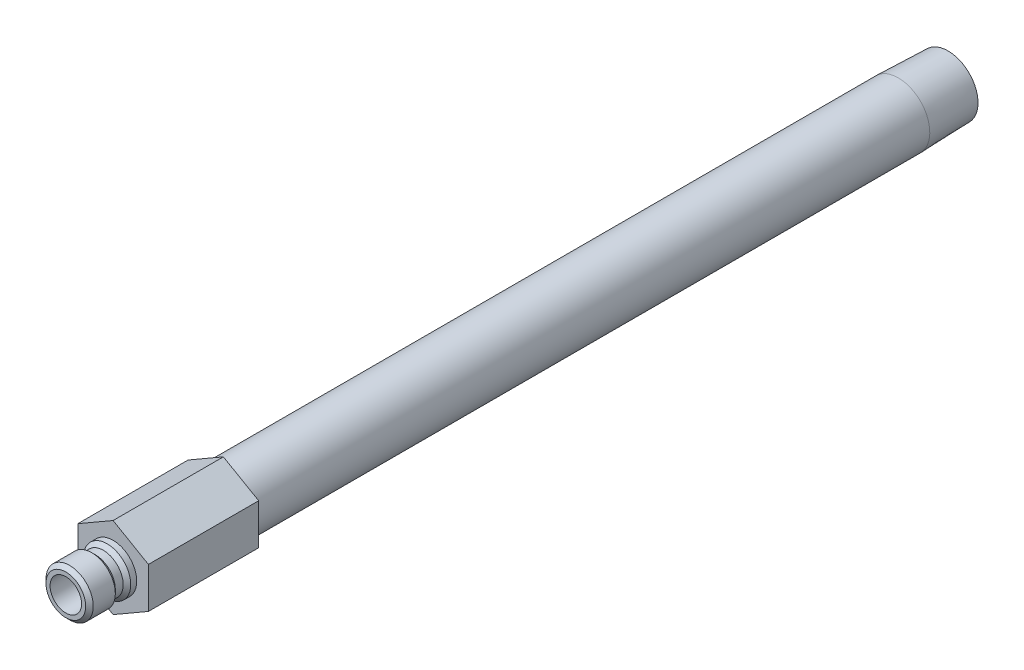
ISO-10303-21;
HEADER;
FILE_DESCRIPTION(('STEP AP214'),'2;1');
FILE_NAME('part.step','',(''),(''),'','','');
FILE_SCHEMA(('AUTOMOTIVE_DESIGN { 1 0 10303 214 1 1 1 1 }'));
ENDSEC;
DATA;
#1=APPLICATION_CONTEXT('core data for automotive mechanical design processes');
#2=APPLICATION_PROTOCOL_DEFINITION('international standard','automotive_design',2000,#1);
#3=PRODUCT_CONTEXT('',#1,'mechanical');
#4=PRODUCT('Part','Part','',(#3));
#5=PRODUCT_RELATED_PRODUCT_CATEGORY('part','',(#4));
#6=PRODUCT_DEFINITION_FORMATION('','',#4);
#7=PRODUCT_DEFINITION_CONTEXT('part definition',#1,'design');
#8=PRODUCT_DEFINITION('design','',#6,#7);
#9=PRODUCT_DEFINITION_SHAPE('','',#8);
#10=(LENGTH_UNIT() NAMED_UNIT(*) SI_UNIT(.MILLI.,.METRE.));
#11=(NAMED_UNIT(*) PLANE_ANGLE_UNIT() SI_UNIT($,.RADIAN.));
#12=(NAMED_UNIT(*) SI_UNIT($,.STERADIAN.) SOLID_ANGLE_UNIT());
#13=UNCERTAINTY_MEASURE_WITH_UNIT(LENGTH_MEASURE(1.E-05),#10,'distance_accuracy_value','');
#14=(GEOMETRIC_REPRESENTATION_CONTEXT(3) GLOBAL_UNCERTAINTY_ASSIGNED_CONTEXT((#13)) GLOBAL_UNIT_ASSIGNED_CONTEXT((#10,
#11,#12)) REPRESENTATION_CONTEXT('',''));
#15=CARTESIAN_POINT('',(0.,0.,0.));
#16=DIRECTION('',(0.,0.,1.));
#17=DIRECTION('',(1.,0.,0.));
#18=AXIS2_PLACEMENT_3D('',#15,#16,#17);
#19=CARTESIAN_POINT('',(0.,0.,0.));
#20=DIRECTION('',(0.,0.,-1.));
#21=DIRECTION('',(0.,1.,0.));
#22=AXIS2_PLACEMENT_3D('',#19,#20,#21);
#23=CYLINDRICAL_SURFACE('',#22,6.34999999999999);
#24=CARTESIAN_POINT('',(0.,0.,-158.242));
#25=DIRECTION('',(0.,0.,-1.));
#26=DIRECTION('',(0.,1.,0.));
#27=AXIS2_PLACEMENT_3D('',#24,#25,#26);
#28=CIRCLE('',#27,6.34999999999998);
#29=CARTESIAN_POINT('',(0.,6.35,-158.242));
#30=VERTEX_POINT('',#29);
#31=EDGE_CURVE('E42',#30,#30,#28,.T.);
#32=ORIENTED_EDGE('',*,*,#31,.F.);
#33=EDGE_LOOP('',(#32));
#34=FACE_BOUND('',#33,.T.);
#35=CARTESIAN_POINT('',(0.,0.,-22.225));
#36=DIRECTION('',(0.,0.,1.));
#37=DIRECTION('',(1.,0.,0.));
#38=AXIS2_PLACEMENT_3D('',#35,#36,#37);
#39=CIRCLE('',#38,6.34999999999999);
#40=CARTESIAN_POINT('',(6.34999999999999,0.,-22.225));
#41=VERTEX_POINT('',#40);
#42=EDGE_CURVE('E138',#41,#41,#39,.F.);
#43=ORIENTED_EDGE('',*,*,#42,.T.);
#44=EDGE_LOOP('',(#43));
#45=FACE_BOUND('',#44,.T.);
#46=ADVANCED_FACE('F33',(#34,#45),#23,.T.);
#47=CARTESIAN_POINT('',(0.,6.03647060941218,-168.275));
#48=DIRECTION('',(0.,0.,-1.));
#49=DIRECTION('',(0.,1.,0.));
#50=AXIS2_PLACEMENT_3D('',#47,#48,#49);
#51=PLANE('',#50);
#52=CARTESIAN_POINT('',(0.,0.,-168.275));
#53=DIRECTION('',(0.,0.,-1.));
#54=DIRECTION('',(0.,1.,0.));
#55=AXIS2_PLACEMENT_3D('',#52,#53,#54);
#56=CIRCLE('',#55,6.03647060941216);
#57=CARTESIAN_POINT('',(0.,6.03647060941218,-168.275));
#58=VERTEX_POINT('',#57);
#59=EDGE_CURVE('E11',#58,#58,#56,.T.);
#60=ORIENTED_EDGE('',*,*,#59,.T.);
#61=EDGE_LOOP('',(#60));
#62=FACE_BOUND('',#61,.T.);
#63=CARTESIAN_POINT('',(0.,0.,-168.275));
#64=DIRECTION('',(0.,0.,-1.));
#65=DIRECTION('',(0.,1.,0.));
#66=AXIS2_PLACEMENT_3D('',#63,#64,#65);
#67=CIRCLE('',#66,4.62279999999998);
#68=CARTESIAN_POINT('',(0.,4.6228,-168.275));
#69=VERTEX_POINT('',#68);
#70=EDGE_CURVE('E146',#69,#69,#67,.T.);
#71=ORIENTED_EDGE('',*,*,#70,.F.);
#72=EDGE_LOOP('',(#71));
#73=FACE_BOUND('',#72,.T.);
#74=ADVANCED_FACE('F35',(#62,#73),#51,.T.);
#75=CARTESIAN_POINT('',(0.,0.,-168.275));
#76=DIRECTION('',(0.,0.,1.));
#77=DIRECTION('',(0.,-1.,0.));
#78=AXIS2_PLACEMENT_3D('',#75,#76,#77);
#79=CONICAL_SURFACE('',#78,6.03647060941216,0.0312396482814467);
#80=ORIENTED_EDGE('',*,*,#31,.T.);
#81=EDGE_LOOP('',(#80));
#82=FACE_BOUND('',#81,.T.);
#83=ORIENTED_EDGE('',*,*,#59,.F.);
#84=EDGE_LOOP('',(#83));
#85=FACE_BOUND('',#84,.T.);
#86=ADVANCED_FACE('F181',(#82,#85),#79,.T.);
#87=CARTESIAN_POINT('',(0.,4.7625,0.));
#88=DIRECTION('',(0.,0.,1.));
#89=DIRECTION('',(0.,-1.,0.));
#90=AXIS2_PLACEMENT_3D('',#87,#88,#89);
#91=PLANE('',#90);
#92=CARTESIAN_POINT('',(0.,0.,0.));
#93=DIRECTION('',(0.,0.,-1.));
#94=DIRECTION('',(0.,1.,0.));
#95=AXIS2_PLACEMENT_3D('',#92,#93,#94);
#96=CIRCLE('',#95,4.7625);
#97=CARTESIAN_POINT('',(0.,4.7625,0.));
#98=VERTEX_POINT('',#97);
#99=EDGE_CURVE('E176',#98,#98,#96,.T.);
#100=ORIENTED_EDGE('',*,*,#99,.T.);
#101=EDGE_LOOP('',(#100));
#102=FACE_BOUND('',#101,.T.);
#103=DIRECTION('',(-0.866025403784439,-0.5,0.));
#104=VECTOR('',#103,1.);
#105=CARTESIAN_POINT('',(0.,8.21223022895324,0.));
#106=LINE('',#105,#104);
#107=CARTESIAN_POINT('',(0.,8.21223022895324,0.));
#108=VERTEX_POINT('',#107);
#109=CARTESIAN_POINT('',(-7.112,4.10611511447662,0.));
#110=VERTEX_POINT('',#109);
#111=EDGE_CURVE('E121',#108,#110,#106,.T.);
#112=ORIENTED_EDGE('',*,*,#111,.T.);
#113=DIRECTION('',(0.,-1.,0.));
#114=VECTOR('',#113,1.);
#115=CARTESIAN_POINT('',(-7.112,4.10611511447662,0.));
#116=LINE('',#115,#114);
#117=CARTESIAN_POINT('',(-7.112,-4.10611511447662,0.));
#118=VERTEX_POINT('',#117);
#119=EDGE_CURVE('E124',#110,#118,#116,.T.);
#120=ORIENTED_EDGE('',*,*,#119,.T.);
#121=DIRECTION('',(0.866025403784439,-0.5,0.));
#122=VECTOR('',#121,1.);
#123=CARTESIAN_POINT('',(-7.112,-4.10611511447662,0.));
#124=LINE('',#123,#122);
#125=CARTESIAN_POINT('',(0.,-8.21223022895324,0.));
#126=VERTEX_POINT('',#125);
#127=EDGE_CURVE('E127',#118,#126,#124,.T.);
#128=ORIENTED_EDGE('',*,*,#127,.T.);
#129=DIRECTION('',(0.866025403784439,0.5,0.));
#130=VECTOR('',#129,1.);
#131=CARTESIAN_POINT('',(0.,-8.21223022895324,0.));
#132=LINE('',#131,#130);
#133=CARTESIAN_POINT('',(7.112,-4.10611511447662,0.));
#134=VERTEX_POINT('',#133);
#135=EDGE_CURVE('E130',#126,#134,#132,.T.);
#136=ORIENTED_EDGE('',*,*,#135,.T.);
#137=DIRECTION('',(0.,1.,0.));
#138=VECTOR('',#137,1.);
#139=CARTESIAN_POINT('',(7.112,-4.10611511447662,0.));
#140=LINE('',#139,#138);
#141=CARTESIAN_POINT('',(7.112,4.10611511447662,0.));
#142=VERTEX_POINT('',#141);
#143=EDGE_CURVE('E98',#134,#142,#140,.T.);
#144=ORIENTED_EDGE('',*,*,#143,.T.);
#145=DIRECTION('',(-0.866025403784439,0.5,0.));
#146=VECTOR('',#145,1.);
#147=CARTESIAN_POINT('',(7.112,4.10611511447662,0.));
#148=LINE('',#147,#146);
#149=EDGE_CURVE('E133',#142,#108,#148,.T.);
#150=ORIENTED_EDGE('',*,*,#149,.T.);
#151=EDGE_LOOP('',(#112,#120,#128,#136,#144,#150));
#152=FACE_BOUND('',#151,.T.);
#153=ADVANCED_FACE('F250',(#102,#152),#91,.T.);
#154=CARTESIAN_POINT('',(0.,0.,0.));
#155=DIRECTION('',(0.,0.,-1.));
#156=DIRECTION('',(0.,1.,0.));
#157=AXIS2_PLACEMENT_3D('',#154,#155,#156);
#158=CYLINDRICAL_SURFACE('',#157,4.7625);
#159=CARTESIAN_POINT('',(0.,0.,1.2065));
#160=DIRECTION('',(0.,0.,-1.));
#161=DIRECTION('',(0.,1.,0.));
#162=AXIS2_PLACEMENT_3D('',#159,#160,#161);
#163=CIRCLE('',#162,4.7625);
#164=CARTESIAN_POINT('',(0.,4.7625,1.2065));
#165=VERTEX_POINT('',#164);
#166=EDGE_CURVE('E173',#165,#165,#163,.T.);
#167=ORIENTED_EDGE('',*,*,#166,.T.);
#168=EDGE_LOOP('',(#167));
#169=FACE_BOUND('',#168,.T.);
#170=ORIENTED_EDGE('',*,*,#99,.F.);
#171=EDGE_LOOP('',(#170));
#172=FACE_BOUND('',#171,.T.);
#173=ADVANCED_FACE('F246',(#169,#172),#158,.T.);
#174=CARTESIAN_POINT('',(0.,0.,1.2065));
#175=DIRECTION('',(0.,0.,-1.));
#176=DIRECTION('',(0.,1.,0.));
#177=AXIS2_PLACEMENT_3D('',#174,#175,#176);
#178=CONICAL_SURFACE('',#177,4.7625,0.785398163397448);
#179=CARTESIAN_POINT('',(0.,0.,1.9685));
#180=DIRECTION('',(0.,0.,-1.));
#181=DIRECTION('',(0.,1.,0.));
#182=AXIS2_PLACEMENT_3D('',#179,#180,#181);
#183=CIRCLE('',#182,4.0005);
#184=CARTESIAN_POINT('',(0.,4.0005,1.9685));
#185=VERTEX_POINT('',#184);
#186=EDGE_CURVE('E170',#185,#185,#183,.T.);
#187=ORIENTED_EDGE('',*,*,#186,.T.);
#188=EDGE_LOOP('',(#187));
#189=FACE_BOUND('',#188,.T.);
#190=ORIENTED_EDGE('',*,*,#166,.F.);
#191=EDGE_LOOP('',(#190));
#192=FACE_BOUND('',#191,.T.);
#193=ADVANCED_FACE('F242',(#189,#192),#178,.T.);
#194=CARTESIAN_POINT('',(0.,0.,0.));
#195=DIRECTION('',(0.,0.,-1.));
#196=DIRECTION('',(0.,1.,0.));
#197=AXIS2_PLACEMENT_3D('',#194,#195,#196);
#198=CYLINDRICAL_SURFACE('',#197,4.0005);
#199=CARTESIAN_POINT('',(0.,0.,3.556));
#200=DIRECTION('',(0.,0.,-1.));
#201=DIRECTION('',(0.,1.,0.));
#202=AXIS2_PLACEMENT_3D('',#199,#200,#201);
#203=CIRCLE('',#202,4.0005);
#204=CARTESIAN_POINT('',(0.,4.0005,3.556));
#205=VERTEX_POINT('',#204);
#206=EDGE_CURVE('E167',#205,#205,#203,.T.);
#207=ORIENTED_EDGE('',*,*,#206,.T.);
#208=EDGE_LOOP('',(#207));
#209=FACE_BOUND('',#208,.T.);
#210=ORIENTED_EDGE('',*,*,#186,.F.);
#211=EDGE_LOOP('',(#210));
#212=FACE_BOUND('',#211,.T.);
#213=ADVANCED_FACE('F238',(#209,#212),#198,.T.);
#214=CARTESIAN_POINT('',(0.,0.,3.556));
#215=DIRECTION('',(0.,0.,1.));
#216=DIRECTION('',(0.,-1.,0.));
#217=AXIS2_PLACEMENT_3D('',#214,#215,#216);
#218=CONICAL_SURFACE('',#217,4.0005,0.785398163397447);
#219=CARTESIAN_POINT('',(0.,0.,4.318));
#220=DIRECTION('',(0.,0.,-1.));
#221=DIRECTION('',(0.,1.,0.));
#222=AXIS2_PLACEMENT_3D('',#219,#220,#221);
#223=CIRCLE('',#222,4.7625);
#224=CARTESIAN_POINT('',(0.,4.7625,4.318));
#225=VERTEX_POINT('',#224);
#226=EDGE_CURVE('E164',#225,#225,#223,.T.);
#227=ORIENTED_EDGE('',*,*,#226,.T.);
#228=EDGE_LOOP('',(#227));
#229=FACE_BOUND('',#228,.T.);
#230=ORIENTED_EDGE('',*,*,#206,.F.);
#231=EDGE_LOOP('',(#230));
#232=FACE_BOUND('',#231,.T.);
#233=ADVANCED_FACE('F234',(#229,#232),#218,.T.);
#234=CARTESIAN_POINT('',(0.,0.,0.));
#235=DIRECTION('',(0.,0.,-1.));
#236=DIRECTION('',(0.,1.,0.));
#237=AXIS2_PLACEMENT_3D('',#234,#235,#236);
#238=CYLINDRICAL_SURFACE('',#237,4.7625);
#239=CARTESIAN_POINT('',(0.,0.,8.763));
#240=DIRECTION('',(0.,0.,-1.));
#241=DIRECTION('',(0.,1.,0.));
#242=AXIS2_PLACEMENT_3D('',#239,#240,#241);
#243=CIRCLE('',#242,4.7625);
#244=CARTESIAN_POINT('',(0.,4.7625,8.763));
#245=VERTEX_POINT('',#244);
#246=EDGE_CURVE('E161',#245,#245,#243,.T.);
#247=ORIENTED_EDGE('',*,*,#246,.T.);
#248=EDGE_LOOP('',(#247));
#249=FACE_BOUND('',#248,.T.);
#250=ORIENTED_EDGE('',*,*,#226,.F.);
#251=EDGE_LOOP('',(#250));
#252=FACE_BOUND('',#251,.T.);
#253=ADVANCED_FACE('F230',(#249,#252),#238,.T.);
#254=CARTESIAN_POINT('',(0.,0.,8.763));
#255=DIRECTION('',(0.,0.,-1.));
#256=DIRECTION('',(0.,1.,0.));
#257=AXIS2_PLACEMENT_3D('',#254,#255,#256);
#258=CONICAL_SURFACE('',#257,4.7625,0.785398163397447);
#259=CARTESIAN_POINT('',(0.,0.,9.525));
#260=DIRECTION('',(0.,0.,-1.));
#261=DIRECTION('',(0.,1.,0.));
#262=AXIS2_PLACEMENT_3D('',#259,#260,#261);
#263=CIRCLE('',#262,4.0005);
#264=CARTESIAN_POINT('',(0.,4.0005,9.525));
#265=VERTEX_POINT('',#264);
#266=EDGE_CURVE('E158',#265,#265,#263,.T.);
#267=ORIENTED_EDGE('',*,*,#266,.T.);
#268=EDGE_LOOP('',(#267));
#269=FACE_BOUND('',#268,.T.);
#270=ORIENTED_EDGE('',*,*,#246,.F.);
#271=EDGE_LOOP('',(#270));
#272=FACE_BOUND('',#271,.T.);
#273=ADVANCED_FACE('F226',(#269,#272),#258,.T.);
#274=CARTESIAN_POINT('',(0.,3.175,9.525));
#275=DIRECTION('',(0.,0.,1.));
#276=DIRECTION('',(0.,-1.,0.));
#277=AXIS2_PLACEMENT_3D('',#274,#275,#276);
#278=PLANE('',#277);
#279=CARTESIAN_POINT('',(0.,0.,9.525));
#280=DIRECTION('',(0.,0.,-1.));
#281=DIRECTION('',(0.,1.,0.));
#282=AXIS2_PLACEMENT_3D('',#279,#280,#281);
#283=CIRCLE('',#282,3.175);
#284=CARTESIAN_POINT('',(0.,3.175,9.525));
#285=VERTEX_POINT('',#284);
#286=EDGE_CURVE('E155',#285,#285,#283,.T.);
#287=ORIENTED_EDGE('',*,*,#286,.T.);
#288=EDGE_LOOP('',(#287));
#289=FACE_BOUND('',#288,.T.);
#290=ORIENTED_EDGE('',*,*,#266,.F.);
#291=EDGE_LOOP('',(#290));
#292=FACE_BOUND('',#291,.T.);
#293=ADVANCED_FACE('F222',(#289,#292),#278,.T.);
#294=CARTESIAN_POINT('',(0.,0.,0.));
#295=DIRECTION('',(0.,0.,-1.));
#296=DIRECTION('',(0.,1.,0.));
#297=AXIS2_PLACEMENT_3D('',#294,#295,#296);
#298=CYLINDRICAL_SURFACE('',#297,3.175);
#299=ORIENTED_EDGE('',*,*,#286,.F.);
#300=EDGE_LOOP('',(#299));
#301=FACE_BOUND('',#300,.T.);
#302=CARTESIAN_POINT('',(0.,0.,-22.225));
#303=DIRECTION('',(0.,0.,-1.));
#304=DIRECTION('',(0.,1.,0.));
#305=AXIS2_PLACEMENT_3D('',#302,#303,#304);
#306=CIRCLE('',#305,3.175);
#307=CARTESIAN_POINT('',(0.,3.175,-22.225));
#308=VERTEX_POINT('',#307);
#309=EDGE_CURVE('E152',#308,#308,#306,.T.);
#310=ORIENTED_EDGE('',*,*,#309,.T.);
#311=EDGE_LOOP('',(#310));
#312=FACE_BOUND('',#311,.T.);
#313=ADVANCED_FACE('F218',(#301,#312),#298,.F.);
#314=CARTESIAN_POINT('',(0.,4.6228,-22.225));
#315=DIRECTION('',(0.,0.,-1.));
#316=DIRECTION('',(0.,1.,0.));
#317=AXIS2_PLACEMENT_3D('',#314,#315,#316);
#318=PLANE('',#317);
#319=CARTESIAN_POINT('',(0.,0.,-22.225));
#320=DIRECTION('',(0.,0.,-1.));
#321=DIRECTION('',(0.,1.,0.));
#322=AXIS2_PLACEMENT_3D('',#319,#320,#321);
#323=CIRCLE('',#322,4.6228);
#324=CARTESIAN_POINT('',(0.,4.6228,-22.225));
#325=VERTEX_POINT('',#324);
#326=EDGE_CURVE('E149',#325,#325,#323,.T.);
#327=ORIENTED_EDGE('',*,*,#326,.T.);
#328=EDGE_LOOP('',(#327));
#329=FACE_BOUND('',#328,.T.);
#330=ORIENTED_EDGE('',*,*,#309,.F.);
#331=EDGE_LOOP('',(#330));
#332=FACE_BOUND('',#331,.T.);
#333=ADVANCED_FACE('F199',(#329,#332),#318,.T.);
#334=CARTESIAN_POINT('',(0.,0.,0.));
#335=DIRECTION('',(0.,0.,-1.));
#336=DIRECTION('',(0.,1.,0.));
#337=AXIS2_PLACEMENT_3D('',#334,#335,#336);
#338=CYLINDRICAL_SURFACE('',#337,4.62279999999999);
#339=ORIENTED_EDGE('',*,*,#70,.T.);
#340=EDGE_LOOP('',(#339));
#341=FACE_BOUND('',#340,.T.);
#342=ORIENTED_EDGE('',*,*,#326,.F.);
#343=EDGE_LOOP('',(#342));
#344=FACE_BOUND('',#343,.T.);
#345=ADVANCED_FACE('F191',(#341,#344),#338,.F.);
#346=CARTESIAN_POINT('',(-7.112,4.10611511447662,-22.225));
#347=DIRECTION('',(0.,0.,1.));
#348=DIRECTION('',(1.,0.,0.));
#349=AXIS2_PLACEMENT_3D('',#346,#347,#348);
#350=PLANE('',#349);
#351=ORIENTED_EDGE('',*,*,#42,.F.);
#352=EDGE_LOOP('',(#351));
#353=FACE_BOUND('',#352,.T.);
#354=DIRECTION('',(-0.866025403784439,-0.5,0.));
#355=VECTOR('',#354,1.);
#356=CARTESIAN_POINT('',(0.,8.21223022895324,-22.225));
#357=LINE('',#356,#355);
#358=CARTESIAN_POINT('',(0.,8.21223022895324,-22.225));
#359=VERTEX_POINT('',#358);
#360=CARTESIAN_POINT('',(-7.112,4.10611511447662,-22.225));
#361=VERTEX_POINT('',#360);
#362=EDGE_CURVE('E136',#359,#361,#357,.T.);
#363=ORIENTED_EDGE('',*,*,#362,.F.);
#364=DIRECTION('',(-0.866025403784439,0.5,0.));
#365=VECTOR('',#364,1.);
#366=CARTESIAN_POINT('',(7.112,4.10611511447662,-22.225));
#367=LINE('',#366,#365);
#368=CARTESIAN_POINT('',(7.112,4.10611511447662,-22.225));
#369=VERTEX_POINT('',#368);
#370=EDGE_CURVE('E111',#369,#359,#367,.T.);
#371=ORIENTED_EDGE('',*,*,#370,.F.);
#372=DIRECTION('',(0.,1.,0.));
#373=VECTOR('',#372,1.);
#374=CARTESIAN_POINT('',(7.112,-4.10611511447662,-22.225));
#375=LINE('',#374,#373);
#376=CARTESIAN_POINT('',(7.112,-4.10611511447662,-22.225));
#377=VERTEX_POINT('',#376);
#378=EDGE_CURVE('E96',#377,#369,#375,.T.);
#379=ORIENTED_EDGE('',*,*,#378,.F.);
#380=DIRECTION('',(0.866025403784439,0.5,0.));
#381=VECTOR('',#380,1.);
#382=CARTESIAN_POINT('',(0.,-8.21223022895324,-22.225));
#383=LINE('',#382,#381);
#384=CARTESIAN_POINT('',(0.,-8.21223022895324,-22.225));
#385=VERTEX_POINT('',#384);
#386=EDGE_CURVE('E109',#385,#377,#383,.T.);
#387=ORIENTED_EDGE('',*,*,#386,.F.);
#388=DIRECTION('',(0.866025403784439,-0.5,0.));
#389=VECTOR('',#388,1.);
#390=CARTESIAN_POINT('',(-7.112,-4.10611511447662,-22.225));
#391=LINE('',#390,#389);
#392=CARTESIAN_POINT('',(-7.112,-4.10611511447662,-22.225));
#393=VERTEX_POINT('',#392);
#394=EDGE_CURVE('E114',#393,#385,#391,.T.);
#395=ORIENTED_EDGE('',*,*,#394,.F.);
#396=DIRECTION('',(0.,-1.,0.));
#397=VECTOR('',#396,1.);
#398=CARTESIAN_POINT('',(-7.112,4.10611511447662,-22.225));
#399=LINE('',#398,#397);
#400=EDGE_CURVE('E116',#361,#393,#399,.T.);
#401=ORIENTED_EDGE('',*,*,#400,.F.);
#402=EDGE_LOOP('',(#363,#371,#379,#387,#395,#401));
#403=FACE_BOUND('',#402,.T.);
#404=ADVANCED_FACE('F107',(#353,#403),#350,.F.);
#405=CARTESIAN_POINT('',(0.,8.21223022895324,-22.225));
#406=DIRECTION('',(-0.5,0.866025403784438,0.));
#407=DIRECTION('',(-0.866025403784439,-0.5,0.));
#408=AXIS2_PLACEMENT_3D('',#405,#406,#407);
#409=PLANE('',#408);
#410=ORIENTED_EDGE('',*,*,#111,.F.);
#411=DIRECTION('',(0.,0.,1.));
#412=VECTOR('',#411,1.);
#413=CARTESIAN_POINT('',(0.,8.21223022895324,-22.225));
#414=LINE('',#413,#412);
#415=EDGE_CURVE('E50',#359,#108,#414,.T.);
#416=ORIENTED_EDGE('',*,*,#415,.F.);
#417=ORIENTED_EDGE('',*,*,#362,.T.);
#418=DIRECTION('',(0.,0.,1.));
#419=VECTOR('',#418,1.);
#420=CARTESIAN_POINT('',(-7.112,4.10611511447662,-22.225));
#421=LINE('',#420,#419);
#422=EDGE_CURVE('E85',#361,#110,#421,.T.);
#423=ORIENTED_EDGE('',*,*,#422,.T.);
#424=EDGE_LOOP('',(#410,#416,#417,#423));
#425=FACE_BOUND('',#424,.T.);
#426=ADVANCED_FACE('F190',(#425),#409,.T.);
#427=CARTESIAN_POINT('',(7.112,4.10611511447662,-22.225));
#428=DIRECTION('',(0.5,0.866025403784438,0.));
#429=DIRECTION('',(-0.866025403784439,0.5,0.));
#430=AXIS2_PLACEMENT_3D('',#427,#428,#429);
#431=PLANE('',#430);
#432=ORIENTED_EDGE('',*,*,#149,.F.);
#433=DIRECTION('',(0.,0.,1.));
#434=VECTOR('',#433,1.);
#435=CARTESIAN_POINT('',(7.112,4.10611511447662,-22.225));
#436=LINE('',#435,#434);
#437=EDGE_CURVE('E73',#369,#142,#436,.T.);
#438=ORIENTED_EDGE('',*,*,#437,.F.);
#439=ORIENTED_EDGE('',*,*,#370,.T.);
#440=ORIENTED_EDGE('',*,*,#415,.T.);
#441=EDGE_LOOP('',(#432,#438,#439,#440));
#442=FACE_BOUND('',#441,.T.);
#443=ADVANCED_FACE('F197',(#442),#431,.T.);
#444=CARTESIAN_POINT('',(7.112,-4.10611511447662,-22.225));
#445=DIRECTION('',(1.,0.,0.));
#446=DIRECTION('',(0.,1.,0.));
#447=AXIS2_PLACEMENT_3D('',#444,#445,#446);
#448=PLANE('',#447);
#449=ORIENTED_EDGE('',*,*,#143,.F.);
#450=DIRECTION('',(0.,0.,1.));
#451=VECTOR('',#450,1.);
#452=CARTESIAN_POINT('',(7.112,-4.10611511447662,-22.225));
#453=LINE('',#452,#451);
#454=EDGE_CURVE('E93',#377,#134,#453,.T.);
#455=ORIENTED_EDGE('',*,*,#454,.F.);
#456=ORIENTED_EDGE('',*,*,#378,.T.);
#457=ORIENTED_EDGE('',*,*,#437,.T.);
#458=EDGE_LOOP('',(#449,#455,#456,#457));
#459=FACE_BOUND('',#458,.T.);
#460=ADVANCED_FACE('F95',(#459),#448,.T.);
#461=CARTESIAN_POINT('',(0.,-8.21223022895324,-22.225));
#462=DIRECTION('',(0.5,-0.866025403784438,0.));
#463=DIRECTION('',(0.866025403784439,0.5,0.));
#464=AXIS2_PLACEMENT_3D('',#461,#462,#463);
#465=PLANE('',#464);
#466=ORIENTED_EDGE('',*,*,#135,.F.);
#467=DIRECTION('',(0.,0.,1.));
#468=VECTOR('',#467,1.);
#469=CARTESIAN_POINT('',(0.,-8.21223022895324,-22.225));
#470=LINE('',#469,#468);
#471=EDGE_CURVE('E103',#385,#126,#470,.T.);
#472=ORIENTED_EDGE('',*,*,#471,.F.);
#473=ORIENTED_EDGE('',*,*,#386,.T.);
#474=ORIENTED_EDGE('',*,*,#454,.T.);
#475=EDGE_LOOP('',(#466,#472,#473,#474));
#476=FACE_BOUND('',#475,.T.);
#477=ADVANCED_FACE('F113',(#476),#465,.T.);
#478=CARTESIAN_POINT('',(-7.112,-4.10611511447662,-22.225));
#479=DIRECTION('',(-0.5,-0.866025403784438,0.));
#480=DIRECTION('',(0.866025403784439,-0.5,0.));
#481=AXIS2_PLACEMENT_3D('',#478,#479,#480);
#482=PLANE('',#481);
#483=ORIENTED_EDGE('',*,*,#127,.F.);
#484=DIRECTION('',(0.,0.,1.));
#485=VECTOR('',#484,1.);
#486=CARTESIAN_POINT('',(-7.112,-4.10611511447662,-22.225));
#487=LINE('',#486,#485);
#488=EDGE_CURVE('E141',#393,#118,#487,.T.);
#489=ORIENTED_EDGE('',*,*,#488,.F.);
#490=ORIENTED_EDGE('',*,*,#394,.T.);
#491=ORIENTED_EDGE('',*,*,#471,.T.);
#492=EDGE_LOOP('',(#483,#489,#490,#491));
#493=FACE_BOUND('',#492,.T.);
#494=ADVANCED_FACE('F209',(#493),#482,.T.);
#495=CARTESIAN_POINT('',(-7.112,4.10611511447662,-22.225));
#496=DIRECTION('',(-1.,0.,0.));
#497=DIRECTION('',(0.,0.,1.));
#498=AXIS2_PLACEMENT_3D('',#495,#496,#497);
#499=PLANE('',#498);
#500=ORIENTED_EDGE('',*,*,#119,.F.);
#501=ORIENTED_EDGE('',*,*,#422,.F.);
#502=ORIENTED_EDGE('',*,*,#400,.T.);
#503=ORIENTED_EDGE('',*,*,#488,.T.);
#504=EDGE_LOOP('',(#500,#501,#502,#503));
#505=FACE_BOUND('',#504,.T.);
#506=ADVANCED_FACE('F212',(#505),#499,.T.);
#507=CLOSED_SHELL('',(#46,#74,#86,#153,#173,#193,#213,#233,#253,#273,#293,#313,#333,#345,#404,
#426,#443,#460,#477,#494,#506));
#508=MANIFOLD_SOLID_BREP('B2',#507);
#509=ADVANCED_BREP_SHAPE_REPRESENTATION('',(#18,#508),#14);
#510=SHAPE_DEFINITION_REPRESENTATION(#9,#509);
ENDSEC;
END-ISO-10303-21;
